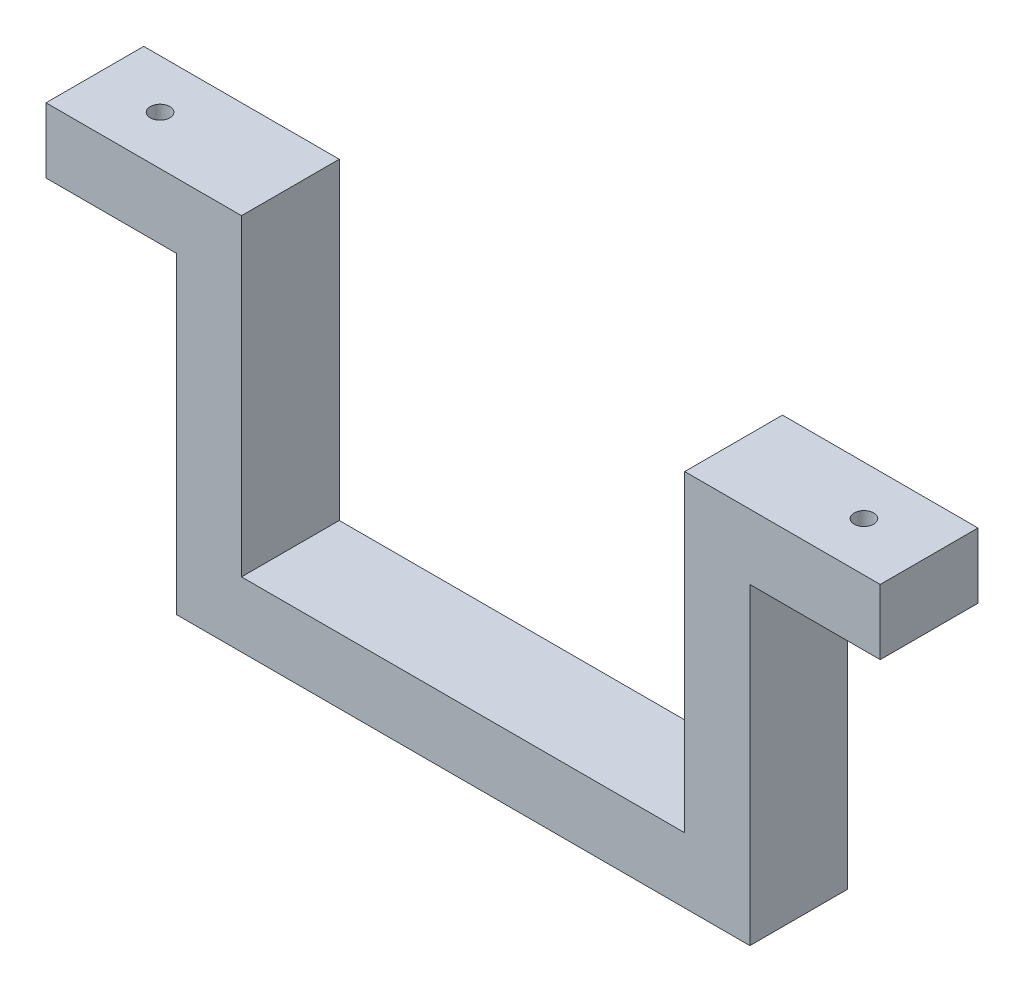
from build123d import *

# Parameters (mm, degrees)
BOSS_EXTRU_1_DEPTH      = 15
ESQUISSE2_R             = 1.5
ENL_V_MAT_EXTRU_1_DEPTH = 120.13437791
CHANFREIN1_SIZE         = 3
ESQUISSE3_R             = 1.5
ENL_V_MAT_EXTRU_2_DEPTH = 120.13437791
CHANFREIN2_SIZE         = 3


with BuildPart() as part:
    # Esquisse1 → Boss.-Extru.1 (new body)
    with BuildSketch(Plane.XY):
        Polygon((0, 0), (88, 0), (88, 48), (108, 48), (108, 58), (78, 58), (78, 10), (10, 10), (10, 58), (-20, 58), (-20, 48), (0, 48), align=None)
    extrude(amount=BOSS_EXTRU_1_DEPTH)

    # Esquisse2 → Enl_v. mat.-Extru.1 (cut, through all)
    with BuildSketch(Plane.XZ.offset(-48)):
        with Locations(Location((98, 7.5, 0), (0, 0, 270))):
            Circle(ESQUISSE2_R)
    extrude(amount=-ENL_V_MAT_EXTRU_1_DEPTH, mode=Mode.SUBTRACT)

    # Chanfrein1
    chanfrein1_edges = [part.edges().sort_by_distance(p)[0] for p in [
        (98, 48, 9),
    ]]
    chamfer(chanfrein1_edges, length=CHANFREIN1_SIZE)

    # Esquisse3 → Enl_v. mat.-Extru.2 (cut, through all)
    with BuildSketch(Plane.XZ.offset(-48)):
        with Locations(Location((-10, 7.5, 0), (0, 0, 270))):
            Circle(ESQUISSE3_R)
    extrude(amount=-ENL_V_MAT_EXTRU_2_DEPTH, mode=Mode.SUBTRACT)

    # Chanfrein2
    chanfrein2_edges = [part.edges().sort_by_distance(p)[0] for p in [
        (-10, 48, 9),
    ]]
    chamfer(chanfrein2_edges, length=CHANFREIN2_SIZE)


solid = part.part
